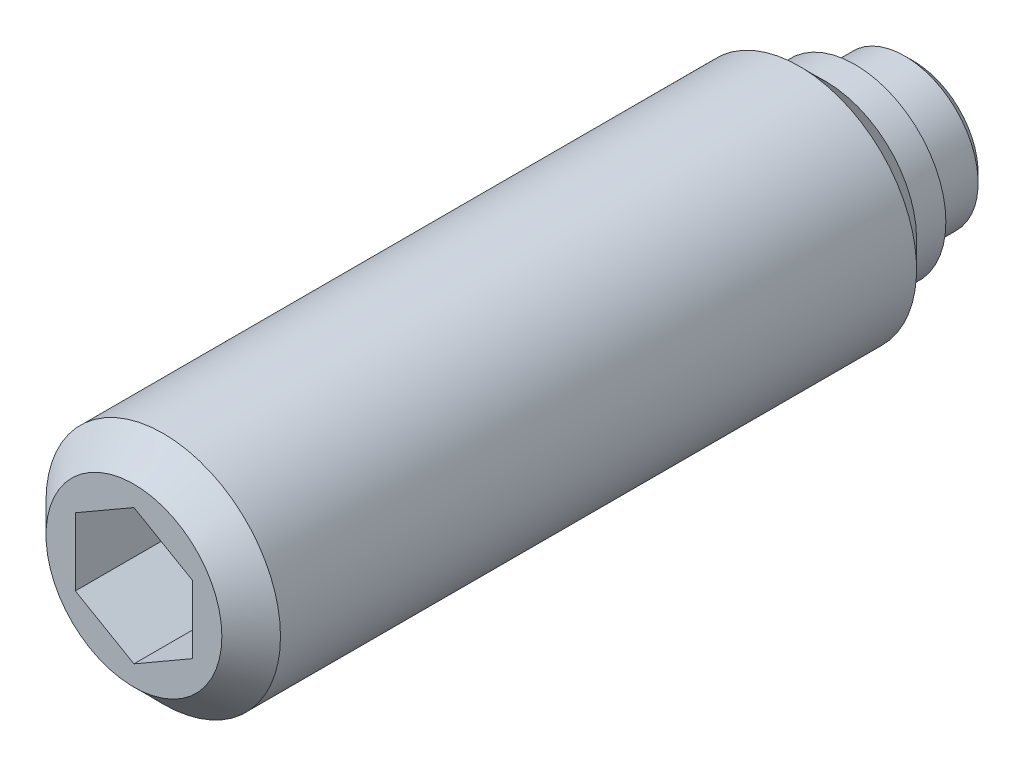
ISO-10303-21;
HEADER;
FILE_DESCRIPTION(('STEP AP214'),'2;1');
FILE_NAME('part.step','',(''),(''),'','','');
FILE_SCHEMA(('AUTOMOTIVE_DESIGN { 1 0 10303 214 1 1 1 1 }'));
ENDSEC;
DATA;
#1=APPLICATION_CONTEXT('core data for automotive mechanical design processes');
#2=APPLICATION_PROTOCOL_DEFINITION('international standard','automotive_design',2000,#1);
#3=PRODUCT_CONTEXT('',#1,'mechanical');
#4=PRODUCT('Part','Part','',(#3));
#5=PRODUCT_RELATED_PRODUCT_CATEGORY('part','',(#4));
#6=PRODUCT_DEFINITION_FORMATION('','',#4);
#7=PRODUCT_DEFINITION_CONTEXT('part definition',#1,'design');
#8=PRODUCT_DEFINITION('design','',#6,#7);
#9=PRODUCT_DEFINITION_SHAPE('','',#8);
#10=(LENGTH_UNIT() NAMED_UNIT(*) SI_UNIT(.MILLI.,.METRE.));
#11=(NAMED_UNIT(*) PLANE_ANGLE_UNIT() SI_UNIT($,.RADIAN.));
#12=(NAMED_UNIT(*) SI_UNIT($,.STERADIAN.) SOLID_ANGLE_UNIT());
#13=UNCERTAINTY_MEASURE_WITH_UNIT(LENGTH_MEASURE(1.E-05),#10,'distance_accuracy_value','');
#14=(GEOMETRIC_REPRESENTATION_CONTEXT(3) GLOBAL_UNCERTAINTY_ASSIGNED_CONTEXT((#13)) GLOBAL_UNIT_ASSIGNED_CONTEXT((#10,
#11,#12)) REPRESENTATION_CONTEXT('',''));
#15=CARTESIAN_POINT('',(0.,0.,0.));
#16=DIRECTION('',(0.,0.,1.));
#17=DIRECTION('',(1.,0.,0.));
#18=AXIS2_PLACEMENT_3D('',#15,#16,#17);
#19=CARTESIAN_POINT('',(0.,0.,0.));
#20=DIRECTION('',(0.,0.,-1.));
#21=DIRECTION('',(-1.,0.,0.));
#22=AXIS2_PLACEMENT_3D('',#19,#20,#21);
#23=CYLINDRICAL_SURFACE('',#22,2.5);
#24=CARTESIAN_POINT('',(0.,0.,0.3));
#25=DIRECTION('',(0.,0.,-1.));
#26=DIRECTION('',(-1.,0.,0.));
#27=AXIS2_PLACEMENT_3D('',#24,#25,#26);
#28=CIRCLE('',#27,2.5);
#29=CARTESIAN_POINT('',(-2.5,0.,0.3));
#30=VERTEX_POINT('',#29);
#31=EDGE_CURVE('E133',#30,#30,#28,.T.);
#32=ORIENTED_EDGE('',*,*,#31,.F.);
#33=EDGE_LOOP('',(#32));
#34=FACE_BOUND('',#33,.T.);
#35=CARTESIAN_POINT('',(0.,0.,2.));
#36=DIRECTION('',(0.,0.,-1.));
#37=DIRECTION('',(-1.,0.,0.));
#38=AXIS2_PLACEMENT_3D('',#35,#36,#37);
#39=CIRCLE('',#38,2.5);
#40=CARTESIAN_POINT('',(-2.5,0.,2.));
#41=VERTEX_POINT('',#40);
#42=EDGE_CURVE('E127',#41,#41,#39,.T.);
#43=ORIENTED_EDGE('',*,*,#42,.T.);
#44=EDGE_LOOP('',(#43));
#45=FACE_BOUND('',#44,.T.);
#46=ADVANCED_FACE('F14',(#34,#45),#23,.T.);
#47=CARTESIAN_POINT('',(0.,0.,0.3));
#48=DIRECTION('',(0.,0.,1.));
#49=DIRECTION('',(1.,0.,0.));
#50=AXIS2_PLACEMENT_3D('',#47,#48,#49);
#51=CONICAL_SURFACE('',#50,2.5,0.785398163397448);
#52=CARTESIAN_POINT('',(0.,0.,0.));
#53=DIRECTION('',(0.,0.,-1.));
#54=DIRECTION('',(-1.,0.,0.));
#55=AXIS2_PLACEMENT_3D('',#52,#53,#54);
#56=CIRCLE('',#55,2.2);
#57=CARTESIAN_POINT('',(-2.2,0.,0.));
#58=VERTEX_POINT('',#57);
#59=EDGE_CURVE('E130',#58,#58,#56,.T.);
#60=ORIENTED_EDGE('',*,*,#59,.F.);
#61=EDGE_LOOP('',(#60));
#62=FACE_BOUND('',#61,.T.);
#63=ORIENTED_EDGE('',*,*,#31,.T.);
#64=EDGE_LOOP('',(#63));
#65=FACE_BOUND('',#64,.T.);
#66=ADVANCED_FACE('F159',(#62,#65),#51,.T.);
#67=CARTESIAN_POINT('',(0.,2.2,0.));
#68=DIRECTION('',(0.,0.,1.));
#69=DIRECTION('',(1.,0.,0.));
#70=AXIS2_PLACEMENT_3D('',#67,#68,#69);
#71=PLANE('',#70);
#72=ORIENTED_EDGE('',*,*,#59,.T.);
#73=EDGE_LOOP('',(#72));
#74=FACE_BOUND('',#73,.T.);
#75=ADVANCED_FACE('F165',(#74),#71,.F.);
#76=CARTESIAN_POINT('',(0.,0.,2.));
#77=DIRECTION('',(0.,0.,-1.));
#78=DIRECTION('',(-1.,0.,0.));
#79=AXIS2_PLACEMENT_3D('',#76,#77,#78);
#80=CYLINDRICAL_SURFACE('',#79,4.);
#81=CARTESIAN_POINT('',(0.,0.,3.9));
#82=DIRECTION('',(0.,0.,-1.));
#83=DIRECTION('',(-1.,0.,0.));
#84=AXIS2_PLACEMENT_3D('',#81,#82,#83);
#85=CIRCLE('',#84,4.);
#86=CARTESIAN_POINT('',(-4.,0.,3.9));
#87=VERTEX_POINT('',#86);
#88=EDGE_CURVE('E9',#87,#87,#85,.T.);
#89=ORIENTED_EDGE('',*,*,#88,.F.);
#90=EDGE_LOOP('',(#89));
#91=FACE_BOUND('',#90,.T.);
#92=CARTESIAN_POINT('',(0.,0.,25.6));
#93=DIRECTION('',(0.,0.,1.));
#94=DIRECTION('',(1.,0.,0.));
#95=AXIS2_PLACEMENT_3D('',#92,#93,#94);
#96=CIRCLE('',#95,4.);
#97=CARTESIAN_POINT('',(4.,0.,25.6));
#98=VERTEX_POINT('',#97);
#99=EDGE_CURVE('E124',#98,#98,#96,.T.);
#100=ORIENTED_EDGE('',*,*,#99,.F.);
#101=EDGE_LOOP('',(#100));
#102=FACE_BOUND('',#101,.T.);
#103=ADVANCED_FACE('F16',(#91,#102),#80,.T.);
#104=CARTESIAN_POINT('',(0.,3.1,2.));
#105=DIRECTION('',(0.,0.,1.));
#106=DIRECTION('',(1.,0.,0.));
#107=AXIS2_PLACEMENT_3D('',#104,#105,#106);
#108=PLANE('',#107);
#109=CARTESIAN_POINT('',(0.,0.,2.));
#110=DIRECTION('',(0.,0.,-1.));
#111=DIRECTION('',(-1.,0.,0.));
#112=AXIS2_PLACEMENT_3D('',#109,#110,#111);
#113=CIRCLE('',#112,3.1);
#114=CARTESIAN_POINT('',(-3.1,0.,2.));
#115=VERTEX_POINT('',#114);
#116=EDGE_CURVE('E136',#115,#115,#113,.T.);
#117=ORIENTED_EDGE('',*,*,#116,.T.);
#118=EDGE_LOOP('',(#117));
#119=FACE_BOUND('',#118,.T.);
#120=ORIENTED_EDGE('',*,*,#42,.F.);
#121=EDGE_LOOP('',(#120));
#122=FACE_BOUND('',#121,.T.);
#123=ADVANCED_FACE('F156',(#119,#122),#108,.F.);
#124=CARTESIAN_POINT('',(0.,0.,2.));
#125=DIRECTION('',(0.,0.,-1.));
#126=DIRECTION('',(-1.,0.,0.));
#127=AXIS2_PLACEMENT_3D('',#124,#125,#126);
#128=CYLINDRICAL_SURFACE('',#127,3.1);
#129=CARTESIAN_POINT('',(0.,0.,3.));
#130=DIRECTION('',(0.,0.,-1.));
#131=DIRECTION('',(-1.,0.,0.));
#132=AXIS2_PLACEMENT_3D('',#129,#130,#131);
#133=CIRCLE('',#132,3.1);
#134=CARTESIAN_POINT('',(-3.1,0.,3.));
#135=VERTEX_POINT('',#134);
#136=EDGE_CURVE('E22',#135,#135,#133,.T.);
#137=ORIENTED_EDGE('',*,*,#136,.T.);
#138=EDGE_LOOP('',(#137));
#139=FACE_BOUND('',#138,.T.);
#140=ORIENTED_EDGE('',*,*,#116,.F.);
#141=EDGE_LOOP('',(#140));
#142=FACE_BOUND('',#141,.T.);
#143=ADVANCED_FACE('F141',(#139,#142),#128,.T.);
#144=CARTESIAN_POINT('',(0.,0.,3.9));
#145=DIRECTION('',(0.,0.,1.));
#146=DIRECTION('',(1.,0.,0.));
#147=AXIS2_PLACEMENT_3D('',#144,#145,#146);
#148=CONICAL_SURFACE('',#147,4.,0.78539816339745);
#149=ORIENTED_EDGE('',*,*,#88,.T.);
#150=EDGE_LOOP('',(#149));
#151=FACE_BOUND('',#150,.T.);
#152=ORIENTED_EDGE('',*,*,#136,.F.);
#153=EDGE_LOOP('',(#152));
#154=FACE_BOUND('',#153,.T.);
#155=ADVANCED_FACE('F144',(#151,#154),#148,.T.);
#156=CARTESIAN_POINT('',(0.,-3.,26.6));
#157=DIRECTION('',(0.,0.,1.));
#158=DIRECTION('',(1.,0.,0.));
#159=AXIS2_PLACEMENT_3D('',#156,#157,#158);
#160=PLANE('',#159);
#161=DIRECTION('',(0.866025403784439,-0.5,0.));
#162=VECTOR('',#161,1.);
#163=CARTESIAN_POINT('',(-2.,-1.15470053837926,26.6));
#164=LINE('',#163,#162);
#165=CARTESIAN_POINT('',(-2.,-1.15470053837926,26.6));
#166=VERTEX_POINT('',#165);
#167=CARTESIAN_POINT('',(0.,-2.30940107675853,26.6));
#168=VERTEX_POINT('',#167);
#169=EDGE_CURVE('E29',#166,#168,#164,.T.);
#170=ORIENTED_EDGE('',*,*,#169,.F.);
#171=DIRECTION('',(0.,-1.,0.));
#172=VECTOR('',#171,1.);
#173=CARTESIAN_POINT('',(-2.,1.15470053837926,26.6));
#174=LINE('',#173,#172);
#175=CARTESIAN_POINT('',(-2.,1.15470053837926,26.6));
#176=VERTEX_POINT('',#175);
#177=EDGE_CURVE('E112',#176,#166,#174,.T.);
#178=ORIENTED_EDGE('',*,*,#177,.F.);
#179=DIRECTION('',(-0.866025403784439,-0.5,0.));
#180=VECTOR('',#179,1.);
#181=CARTESIAN_POINT('',(0.,2.30940107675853,26.6));
#182=LINE('',#181,#180);
#183=CARTESIAN_POINT('',(0.,2.30940107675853,26.6));
#184=VERTEX_POINT('',#183);
#185=EDGE_CURVE('E110',#184,#176,#182,.T.);
#186=ORIENTED_EDGE('',*,*,#185,.F.);
#187=DIRECTION('',(-0.866025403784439,0.5,0.));
#188=VECTOR('',#187,1.);
#189=CARTESIAN_POINT('',(2.,1.15470053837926,26.6));
#190=LINE('',#189,#188);
#191=CARTESIAN_POINT('',(2.,1.15470053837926,26.6));
#192=VERTEX_POINT('',#191);
#193=EDGE_CURVE('E77',#192,#184,#190,.T.);
#194=ORIENTED_EDGE('',*,*,#193,.F.);
#195=DIRECTION('',(0.,1.,0.));
#196=VECTOR('',#195,1.);
#197=CARTESIAN_POINT('',(2.,-1.15470053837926,26.6));
#198=LINE('',#197,#196);
#199=CARTESIAN_POINT('',(2.,-1.15470053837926,26.6));
#200=VERTEX_POINT('',#199);
#201=EDGE_CURVE('E106',#200,#192,#198,.T.);
#202=ORIENTED_EDGE('',*,*,#201,.F.);
#203=DIRECTION('',(0.866025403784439,0.5,0.));
#204=VECTOR('',#203,1.);
#205=CARTESIAN_POINT('',(0.,-2.30940107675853,26.6));
#206=LINE('',#205,#204);
#207=EDGE_CURVE('E103',#168,#200,#206,.T.);
#208=ORIENTED_EDGE('',*,*,#207,.F.);
#209=EDGE_LOOP('',(#170,#178,#186,#194,#202,#208));
#210=FACE_BOUND('',#209,.T.);
#211=CARTESIAN_POINT('',(0.,0.,26.6));
#212=DIRECTION('',(0.,0.,1.));
#213=DIRECTION('',(1.,0.,0.));
#214=AXIS2_PLACEMENT_3D('',#211,#212,#213);
#215=CIRCLE('',#214,3.);
#216=CARTESIAN_POINT('',(3.,0.,26.6));
#217=VERTEX_POINT('',#216);
#218=EDGE_CURVE('E116',#217,#217,#215,.T.);
#219=ORIENTED_EDGE('',*,*,#218,.T.);
#220=EDGE_LOOP('',(#219));
#221=FACE_BOUND('',#220,.T.);
#222=ADVANCED_FACE('F146',(#210,#221),#160,.T.);
#223=CARTESIAN_POINT('',(0.,0.,26.6));
#224=DIRECTION('',(0.,0.,-1.));
#225=DIRECTION('',(-1.,0.,0.));
#226=AXIS2_PLACEMENT_3D('',#223,#224,#225);
#227=CONICAL_SURFACE('',#226,3.,0.785398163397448);
#228=ORIENTED_EDGE('',*,*,#99,.T.);
#229=EDGE_LOOP('',(#228));
#230=FACE_BOUND('',#229,.T.);
#231=ORIENTED_EDGE('',*,*,#218,.F.);
#232=EDGE_LOOP('',(#231));
#233=FACE_BOUND('',#232,.T.);
#234=ADVANCED_FACE('F153',(#230,#233),#227,.T.);
#235=CARTESIAN_POINT('',(-2.,-1.15470053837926,21.6));
#236=DIRECTION('',(-0.5,-0.866025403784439,0.));
#237=DIRECTION('',(0.866025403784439,-0.5,0.));
#238=AXIS2_PLACEMENT_3D('',#235,#236,#237);
#239=PLANE('',#238);
#240=ORIENTED_EDGE('',*,*,#169,.T.);
#241=DIRECTION('',(0.,0.,1.));
#242=VECTOR('',#241,1.);
#243=CARTESIAN_POINT('',(0.,-2.30940107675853,21.6));
#244=LINE('',#243,#242);
#245=CARTESIAN_POINT('',(0.,-2.30940107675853,21.6));
#246=VERTEX_POINT('',#245);
#247=EDGE_CURVE('E59',#246,#168,#244,.T.);
#248=ORIENTED_EDGE('',*,*,#247,.F.);
#249=DIRECTION('',(0.866025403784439,-0.5,0.));
#250=VECTOR('',#249,1.);
#251=CARTESIAN_POINT('',(-2.,-1.15470053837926,21.6));
#252=LINE('',#251,#250);
#253=CARTESIAN_POINT('',(-2.,-1.15470053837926,21.6));
#254=VERTEX_POINT('',#253);
#255=EDGE_CURVE('E114',#254,#246,#252,.T.);
#256=ORIENTED_EDGE('',*,*,#255,.F.);
#257=DIRECTION('',(0.,0.,1.));
#258=VECTOR('',#257,1.);
#259=CARTESIAN_POINT('',(-2.,-1.15470053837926,21.6));
#260=LINE('',#259,#258);
#261=EDGE_CURVE('E37',#254,#166,#260,.T.);
#262=ORIENTED_EDGE('',*,*,#261,.T.);
#263=EDGE_LOOP('',(#240,#248,#256,#262));
#264=FACE_BOUND('',#263,.T.);
#265=ADVANCED_FACE('F191',(#264),#239,.F.);
#266=CARTESIAN_POINT('',(-2.,1.15470053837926,21.6));
#267=DIRECTION('',(-1.,0.,0.));
#268=DIRECTION('',(0.,0.,1.));
#269=AXIS2_PLACEMENT_3D('',#266,#267,#268);
#270=PLANE('',#269);
#271=ORIENTED_EDGE('',*,*,#177,.T.);
#272=ORIENTED_EDGE('',*,*,#261,.F.);
#273=DIRECTION('',(0.,-1.,0.));
#274=VECTOR('',#273,1.);
#275=CARTESIAN_POINT('',(-2.,1.15470053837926,21.6));
#276=LINE('',#275,#274);
#277=CARTESIAN_POINT('',(-2.,1.15470053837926,21.6));
#278=VERTEX_POINT('',#277);
#279=EDGE_CURVE('E89',#278,#254,#276,.T.);
#280=ORIENTED_EDGE('',*,*,#279,.F.);
#281=DIRECTION('',(0.,0.,1.));
#282=VECTOR('',#281,1.);
#283=CARTESIAN_POINT('',(-2.,1.15470053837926,21.6));
#284=LINE('',#283,#282);
#285=EDGE_CURVE('E81',#278,#176,#284,.T.);
#286=ORIENTED_EDGE('',*,*,#285,.T.);
#287=EDGE_LOOP('',(#271,#272,#280,#286));
#288=FACE_BOUND('',#287,.T.);
#289=ADVANCED_FACE('F198',(#288),#270,.F.);
#290=CARTESIAN_POINT('',(0.,2.30940107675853,21.6));
#291=DIRECTION('',(-0.5,0.866025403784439,0.));
#292=DIRECTION('',(-0.866025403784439,-0.5,0.));
#293=AXIS2_PLACEMENT_3D('',#290,#291,#292);
#294=PLANE('',#293);
#295=ORIENTED_EDGE('',*,*,#185,.T.);
#296=ORIENTED_EDGE('',*,*,#285,.F.);
#297=DIRECTION('',(-0.866025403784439,-0.5,0.));
#298=VECTOR('',#297,1.);
#299=CARTESIAN_POINT('',(0.,2.30940107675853,21.6));
#300=LINE('',#299,#298);
#301=CARTESIAN_POINT('',(0.,2.30940107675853,21.6));
#302=VERTEX_POINT('',#301);
#303=EDGE_CURVE('E85',#302,#278,#300,.T.);
#304=ORIENTED_EDGE('',*,*,#303,.F.);
#305=DIRECTION('',(0.,0.,1.));
#306=VECTOR('',#305,1.);
#307=CARTESIAN_POINT('',(0.,2.30940107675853,21.6));
#308=LINE('',#307,#306);
#309=EDGE_CURVE('E70',#302,#184,#308,.T.);
#310=ORIENTED_EDGE('',*,*,#309,.T.);
#311=EDGE_LOOP('',(#295,#296,#304,#310));
#312=FACE_BOUND('',#311,.T.);
#313=ADVANCED_FACE('F86',(#312),#294,.F.);
#314=CARTESIAN_POINT('',(2.,1.15470053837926,21.6));
#315=DIRECTION('',(0.5,0.866025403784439,0.));
#316=DIRECTION('',(-0.866025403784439,0.5,0.));
#317=AXIS2_PLACEMENT_3D('',#314,#315,#316);
#318=PLANE('',#317);
#319=ORIENTED_EDGE('',*,*,#193,.T.);
#320=ORIENTED_EDGE('',*,*,#309,.F.);
#321=DIRECTION('',(-0.866025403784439,0.5,0.));
#322=VECTOR('',#321,1.);
#323=CARTESIAN_POINT('',(2.,1.15470053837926,21.6));
#324=LINE('',#323,#322);
#325=CARTESIAN_POINT('',(2.,1.15470053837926,21.6));
#326=VERTEX_POINT('',#325);
#327=EDGE_CURVE('E74',#326,#302,#324,.T.);
#328=ORIENTED_EDGE('',*,*,#327,.F.);
#329=DIRECTION('',(0.,0.,1.));
#330=VECTOR('',#329,1.);
#331=CARTESIAN_POINT('',(2.,1.15470053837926,21.6));
#332=LINE('',#331,#330);
#333=EDGE_CURVE('E82',#326,#192,#332,.T.);
#334=ORIENTED_EDGE('',*,*,#333,.T.);
#335=EDGE_LOOP('',(#319,#320,#328,#334));
#336=FACE_BOUND('',#335,.T.);
#337=ADVANCED_FACE('F72',(#336),#318,.F.);
#338=CARTESIAN_POINT('',(2.,-1.15470053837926,21.6));
#339=DIRECTION('',(1.,0.,0.));
#340=DIRECTION('',(0.,0.,-1.));
#341=AXIS2_PLACEMENT_3D('',#338,#339,#340);
#342=PLANE('',#341);
#343=ORIENTED_EDGE('',*,*,#201,.T.);
#344=ORIENTED_EDGE('',*,*,#333,.F.);
#345=DIRECTION('',(0.,1.,0.));
#346=VECTOR('',#345,1.);
#347=CARTESIAN_POINT('',(2.,-1.15470053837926,21.6));
#348=LINE('',#347,#346);
#349=CARTESIAN_POINT('',(2.,-1.15470053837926,21.6));
#350=VERTEX_POINT('',#349);
#351=EDGE_CURVE('E95',#350,#326,#348,.T.);
#352=ORIENTED_EDGE('',*,*,#351,.F.);
#353=DIRECTION('',(0.,0.,1.));
#354=VECTOR('',#353,1.);
#355=CARTESIAN_POINT('',(2.,-1.15470053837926,21.6));
#356=LINE('',#355,#354);
#357=EDGE_CURVE('E119',#350,#200,#356,.T.);
#358=ORIENTED_EDGE('',*,*,#357,.T.);
#359=EDGE_LOOP('',(#343,#344,#352,#358));
#360=FACE_BOUND('',#359,.T.);
#361=ADVANCED_FACE('F204',(#360),#342,.F.);
#362=CARTESIAN_POINT('',(0.,-2.30940107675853,21.6));
#363=DIRECTION('',(0.5,-0.866025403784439,0.));
#364=DIRECTION('',(0.866025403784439,0.5,0.));
#365=AXIS2_PLACEMENT_3D('',#362,#363,#364);
#366=PLANE('',#365);
#367=ORIENTED_EDGE('',*,*,#207,.T.);
#368=ORIENTED_EDGE('',*,*,#357,.F.);
#369=DIRECTION('',(0.866025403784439,0.5,0.));
#370=VECTOR('',#369,1.);
#371=CARTESIAN_POINT('',(0.,-2.30940107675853,21.6));
#372=LINE('',#371,#370);
#373=EDGE_CURVE('E97',#246,#350,#372,.T.);
#374=ORIENTED_EDGE('',*,*,#373,.F.);
#375=ORIENTED_EDGE('',*,*,#247,.T.);
#376=EDGE_LOOP('',(#367,#368,#374,#375));
#377=FACE_BOUND('',#376,.T.);
#378=ADVANCED_FACE('F201',(#377),#366,.F.);
#379=CARTESIAN_POINT('',(0.,0.,21.6));
#380=DIRECTION('',(0.,0.,1.));
#381=DIRECTION('',(1.,0.,0.));
#382=AXIS2_PLACEMENT_3D('',#379,#380,#381);
#383=PLANE('',#382);
#384=ORIENTED_EDGE('',*,*,#255,.T.);
#385=ORIENTED_EDGE('',*,*,#373,.T.);
#386=ORIENTED_EDGE('',*,*,#351,.T.);
#387=ORIENTED_EDGE('',*,*,#327,.T.);
#388=ORIENTED_EDGE('',*,*,#303,.T.);
#389=ORIENTED_EDGE('',*,*,#279,.T.);
#390=EDGE_LOOP('',(#384,#385,#386,#387,#388,#389));
#391=FACE_BOUND('',#390,.T.);
#392=ADVANCED_FACE('F92',(#391),#383,.T.);
#393=CLOSED_SHELL('',(#46,#66,#75,#103,#123,#143,#155,#222,#234,#265,#289,#313,#337,#361,#378,#392));
#394=MANIFOLD_SOLID_BREP('B1',#393);
#395=ADVANCED_BREP_SHAPE_REPRESENTATION('',(#18,#394),#14);
#396=SHAPE_DEFINITION_REPRESENTATION(#9,#395);
ENDSEC;
END-ISO-10303-21;
